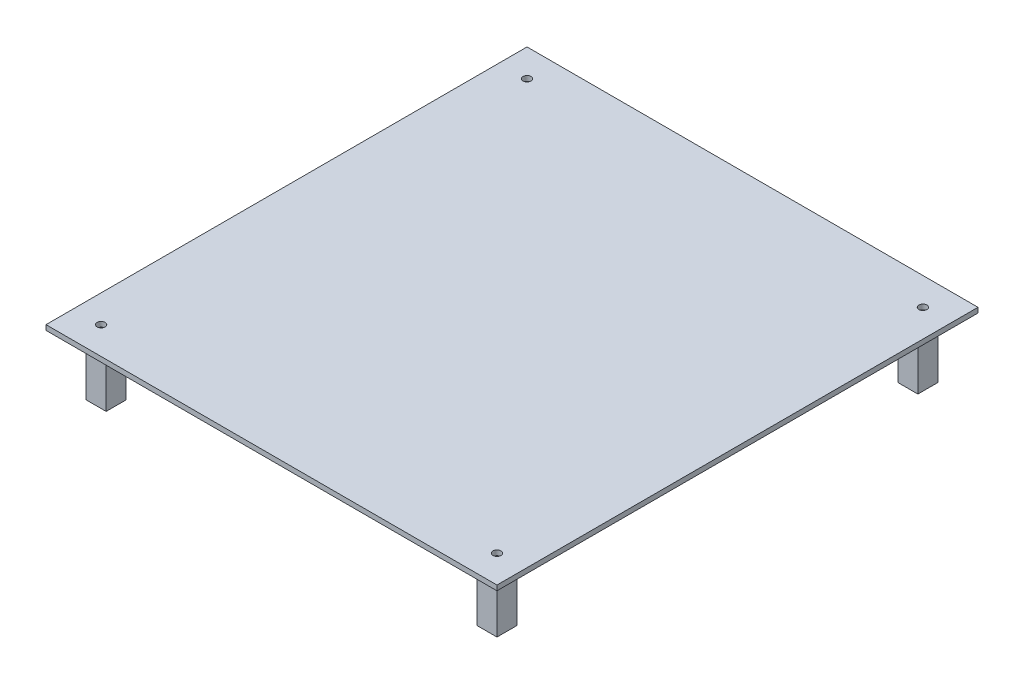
ISO-10303-21;
HEADER;
FILE_DESCRIPTION(('STEP AP214'),'2;1');
FILE_NAME('part.step','',(''),(''),'','','');
FILE_SCHEMA(('AUTOMOTIVE_DESIGN { 1 0 10303 214 1 1 1 1 }'));
ENDSEC;
DATA;
#1=APPLICATION_CONTEXT('core data for automotive mechanical design processes');
#2=APPLICATION_PROTOCOL_DEFINITION('international standard','automotive_design',2000,#1);
#3=PRODUCT_CONTEXT('',#1,'mechanical');
#4=PRODUCT('Part','Part','',(#3));
#5=PRODUCT_RELATED_PRODUCT_CATEGORY('part','',(#4));
#6=PRODUCT_DEFINITION_FORMATION('','',#4);
#7=PRODUCT_DEFINITION_CONTEXT('part definition',#1,'design');
#8=PRODUCT_DEFINITION('design','',#6,#7);
#9=PRODUCT_DEFINITION_SHAPE('','',#8);
#10=(LENGTH_UNIT() NAMED_UNIT(*) SI_UNIT(.MILLI.,.METRE.));
#11=(NAMED_UNIT(*) PLANE_ANGLE_UNIT() SI_UNIT($,.RADIAN.));
#12=(NAMED_UNIT(*) SI_UNIT($,.STERADIAN.) SOLID_ANGLE_UNIT());
#13=UNCERTAINTY_MEASURE_WITH_UNIT(LENGTH_MEASURE(1.E-05),#10,'distance_accuracy_value','');
#14=(GEOMETRIC_REPRESENTATION_CONTEXT(3) GLOBAL_UNCERTAINTY_ASSIGNED_CONTEXT((#13)) GLOBAL_UNIT_ASSIGNED_CONTEXT((#10,
#11,#12)) REPRESENTATION_CONTEXT('',''));
#15=CARTESIAN_POINT('',(0.,0.,0.));
#16=DIRECTION('',(0.,0.,1.));
#17=DIRECTION('',(1.,0.,0.));
#18=AXIS2_PLACEMENT_3D('',#15,#16,#17);
#19=CARTESIAN_POINT('',(520.7,-152.4,558.8));
#20=DIRECTION('',(1.,0.,0.));
#21=DIRECTION('',(0.,0.,-1.));
#22=AXIS2_PLACEMENT_3D('',#19,#20,#21);
#23=PLANE('',#22);
#24=DIRECTION('',(0.,0.,-1.));
#25=VECTOR('',#24,1.);
#26=CARTESIAN_POINT('',(520.7,0.,558.8));
#27=LINE('',#26,#25);
#28=CARTESIAN_POINT('',(520.7,0.,558.8));
#29=VERTEX_POINT('',#28);
#30=CARTESIAN_POINT('',(520.7,0.,508.));
#31=VERTEX_POINT('',#30);
#32=EDGE_CURVE('E156',#29,#31,#27,.T.);
#33=ORIENTED_EDGE('',*,*,#32,.F.);
#34=DIRECTION('',(0.,1.,0.));
#35=VECTOR('',#34,1.);
#36=CARTESIAN_POINT('',(520.7,-152.4,558.8));
#37=LINE('',#36,#35);
#38=CARTESIAN_POINT('',(520.7,-152.4,558.8));
#39=VERTEX_POINT('',#38);
#40=EDGE_CURVE('E12',#39,#29,#37,.T.);
#41=ORIENTED_EDGE('',*,*,#40,.F.);
#42=DIRECTION('',(0.,0.,-1.));
#43=VECTOR('',#42,1.);
#44=CARTESIAN_POINT('',(520.7,-152.4,558.8));
#45=LINE('',#44,#43);
#46=CARTESIAN_POINT('',(520.7,-152.4,508.));
#47=VERTEX_POINT('',#46);
#48=EDGE_CURVE('E160',#39,#47,#45,.T.);
#49=ORIENTED_EDGE('',*,*,#48,.T.);
#50=DIRECTION('',(0.,1.,0.));
#51=VECTOR('',#50,1.);
#52=CARTESIAN_POINT('',(520.7,-152.4,508.));
#53=LINE('',#52,#51);
#54=EDGE_CURVE('E61',#47,#31,#53,.T.);
#55=ORIENTED_EDGE('',*,*,#54,.T.);
#56=EDGE_LOOP('',(#33,#41,#49,#55));
#57=FACE_BOUND('',#56,.T.);
#58=ADVANCED_FACE('F58',(#57),#23,.T.);
#59=CARTESIAN_POINT('',(520.7,-152.4,558.8));
#60=DIRECTION('',(0.,0.,1.));
#61=DIRECTION('',(1.,0.,0.));
#62=AXIS2_PLACEMENT_3D('',#59,#60,#61);
#63=PLANE('',#62);
#64=DIRECTION('',(1.,0.,0.));
#65=VECTOR('',#64,1.);
#66=CARTESIAN_POINT('',(520.7,0.,558.8));
#67=LINE('',#66,#65);
#68=CARTESIAN_POINT('',(469.9,0.,558.8));
#69=VERTEX_POINT('',#68);
#70=EDGE_CURVE('E164',#69,#29,#67,.T.);
#71=ORIENTED_EDGE('',*,*,#70,.F.);
#72=DIRECTION('',(0.,1.,0.));
#73=VECTOR('',#72,1.);
#74=CARTESIAN_POINT('',(469.9,-152.4,558.8));
#75=LINE('',#74,#73);
#76=CARTESIAN_POINT('',(469.9,-152.4,558.8));
#77=VERTEX_POINT('',#76);
#78=EDGE_CURVE('E66',#77,#69,#75,.T.);
#79=ORIENTED_EDGE('',*,*,#78,.F.);
#80=DIRECTION('',(1.,0.,0.));
#81=VECTOR('',#80,1.);
#82=CARTESIAN_POINT('',(520.7,-152.4,558.8));
#83=LINE('',#82,#81);
#84=EDGE_CURVE('E168',#77,#39,#83,.T.);
#85=ORIENTED_EDGE('',*,*,#84,.T.);
#86=ORIENTED_EDGE('',*,*,#40,.T.);
#87=EDGE_LOOP('',(#71,#79,#85,#86));
#88=FACE_BOUND('',#87,.T.);
#89=ADVANCED_FACE('F194',(#88),#63,.T.);
#90=CARTESIAN_POINT('',(469.9,-152.4,558.8));
#91=DIRECTION('',(-1.,0.,0.));
#92=DIRECTION('',(0.,0.,1.));
#93=AXIS2_PLACEMENT_3D('',#90,#91,#92);
#94=PLANE('',#93);
#95=DIRECTION('',(0.,0.,1.));
#96=VECTOR('',#95,1.);
#97=CARTESIAN_POINT('',(469.9,0.,558.8));
#98=LINE('',#97,#96);
#99=CARTESIAN_POINT('',(469.9,0.,508.));
#100=VERTEX_POINT('',#99);
#101=EDGE_CURVE('E174',#100,#69,#98,.T.);
#102=ORIENTED_EDGE('',*,*,#101,.F.);
#103=DIRECTION('',(0.,1.,0.));
#104=VECTOR('',#103,1.);
#105=CARTESIAN_POINT('',(469.9,-152.4,508.));
#106=LINE('',#105,#104);
#107=CARTESIAN_POINT('',(469.9,-152.4,508.));
#108=VERTEX_POINT('',#107);
#109=EDGE_CURVE('E178',#108,#100,#106,.T.);
#110=ORIENTED_EDGE('',*,*,#109,.F.);
#111=DIRECTION('',(0.,0.,1.));
#112=VECTOR('',#111,1.);
#113=CARTESIAN_POINT('',(469.9,-152.4,558.8));
#114=LINE('',#113,#112);
#115=EDGE_CURVE('E166',#108,#77,#114,.T.);
#116=ORIENTED_EDGE('',*,*,#115,.T.);
#117=ORIENTED_EDGE('',*,*,#78,.T.);
#118=EDGE_LOOP('',(#102,#110,#116,#117));
#119=FACE_BOUND('',#118,.T.);
#120=ADVANCED_FACE('F199',(#119),#94,.T.);
#121=CARTESIAN_POINT('',(520.7,-152.4,508.));
#122=DIRECTION('',(0.,0.,-1.));
#123=DIRECTION('',(-1.,0.,0.));
#124=AXIS2_PLACEMENT_3D('',#121,#122,#123);
#125=PLANE('',#124);
#126=DIRECTION('',(-1.,0.,0.));
#127=VECTOR('',#126,1.);
#128=CARTESIAN_POINT('',(520.7,0.,508.));
#129=LINE('',#128,#127);
#130=EDGE_CURVE('E172',#31,#100,#129,.T.);
#131=ORIENTED_EDGE('',*,*,#130,.F.);
#132=ORIENTED_EDGE('',*,*,#54,.F.);
#133=DIRECTION('',(-1.,0.,0.));
#134=VECTOR('',#133,1.);
#135=CARTESIAN_POINT('',(520.7,-152.4,508.));
#136=LINE('',#135,#134);
#137=EDGE_CURVE('E163',#47,#108,#136,.T.);
#138=ORIENTED_EDGE('',*,*,#137,.T.);
#139=ORIENTED_EDGE('',*,*,#109,.T.);
#140=EDGE_LOOP('',(#131,#132,#138,#139));
#141=FACE_BOUND('',#140,.T.);
#142=ADVANCED_FACE('F197',(#141),#125,.T.);
#143=CARTESIAN_POINT('',(0.,-152.4,0.));
#144=DIRECTION('',(0.,1.,0.));
#145=DIRECTION('',(0.,0.,-1.));
#146=AXIS2_PLACEMENT_3D('',#143,#144,#145);
#147=PLANE('',#146);
#148=DIRECTION('',(1.,0.,0.));
#149=VECTOR('',#148,1.);
#150=CARTESIAN_POINT('',(517.525,-152.4,555.625));
#151=LINE('',#150,#149);
#152=CARTESIAN_POINT('',(473.075,-152.4,555.625));
#153=VERTEX_POINT('',#152);
#154=CARTESIAN_POINT('',(517.525,-152.4,555.625));
#155=VERTEX_POINT('',#154);
#156=EDGE_CURVE('E129',#153,#155,#151,.T.);
#157=ORIENTED_EDGE('',*,*,#156,.T.);
#158=DIRECTION('',(0.,0.,-1.));
#159=VECTOR('',#158,1.);
#160=CARTESIAN_POINT('',(517.525,-152.4,555.625));
#161=LINE('',#160,#159);
#162=CARTESIAN_POINT('',(517.525,-152.4,511.175));
#163=VERTEX_POINT('',#162);
#164=EDGE_CURVE('E125',#155,#163,#161,.T.);
#165=ORIENTED_EDGE('',*,*,#164,.T.);
#166=DIRECTION('',(-1.,0.,0.));
#167=VECTOR('',#166,1.);
#168=CARTESIAN_POINT('',(517.525,-152.4,511.175));
#169=LINE('',#168,#167);
#170=CARTESIAN_POINT('',(473.075,-152.4,511.175));
#171=VERTEX_POINT('',#170);
#172=EDGE_CURVE('E132',#163,#171,#169,.T.);
#173=ORIENTED_EDGE('',*,*,#172,.T.);
#174=DIRECTION('',(0.,0.,1.));
#175=VECTOR('',#174,1.);
#176=CARTESIAN_POINT('',(473.075,-152.4,555.625));
#177=LINE('',#176,#175);
#178=EDGE_CURVE('E136',#171,#153,#177,.T.);
#179=ORIENTED_EDGE('',*,*,#178,.T.);
#180=EDGE_LOOP('',(#157,#165,#173,#179));
#181=FACE_BOUND('',#180,.T.);
#182=ORIENTED_EDGE('',*,*,#48,.F.);
#183=ORIENTED_EDGE('',*,*,#84,.F.);
#184=ORIENTED_EDGE('',*,*,#115,.F.);
#185=ORIENTED_EDGE('',*,*,#137,.F.);
#186=EDGE_LOOP('',(#182,#183,#184,#185));
#187=FACE_BOUND('',#186,.T.);
#188=ADVANCED_FACE('F138',(#181,#187),#147,.F.);
#189=CARTESIAN_POINT('',(0.,0.,0.));
#190=DIRECTION('',(0.,1.,0.));
#191=DIRECTION('',(0.,0.,-1.));
#192=AXIS2_PLACEMENT_3D('',#189,#190,#191);
#193=PLANE('',#192);
#194=DIRECTION('',(0.,0.,-1.));
#195=VECTOR('',#194,1.);
#196=CARTESIAN_POINT('',(517.525,0.,555.625));
#197=LINE('',#196,#195);
#198=CARTESIAN_POINT('',(517.525,0.,555.625));
#199=VERTEX_POINT('',#198);
#200=CARTESIAN_POINT('',(517.525,0.,511.175));
#201=VERTEX_POINT('',#200);
#202=EDGE_CURVE('E128',#199,#201,#197,.T.);
#203=ORIENTED_EDGE('',*,*,#202,.F.);
#204=DIRECTION('',(1.,0.,0.));
#205=VECTOR('',#204,1.);
#206=CARTESIAN_POINT('',(517.525,0.,555.625));
#207=LINE('',#206,#205);
#208=CARTESIAN_POINT('',(473.075,0.,555.625));
#209=VERTEX_POINT('',#208);
#210=EDGE_CURVE('E141',#209,#199,#207,.T.);
#211=ORIENTED_EDGE('',*,*,#210,.F.);
#212=DIRECTION('',(0.,0.,1.));
#213=VECTOR('',#212,1.);
#214=CARTESIAN_POINT('',(473.075,0.,555.625));
#215=LINE('',#214,#213);
#216=CARTESIAN_POINT('',(473.075,0.,511.175));
#217=VERTEX_POINT('',#216);
#218=EDGE_CURVE('E144',#217,#209,#215,.T.);
#219=ORIENTED_EDGE('',*,*,#218,.F.);
#220=DIRECTION('',(-1.,0.,0.));
#221=VECTOR('',#220,1.);
#222=CARTESIAN_POINT('',(517.525,0.,511.175));
#223=LINE('',#222,#221);
#224=EDGE_CURVE('E150',#201,#217,#223,.T.);
#225=ORIENTED_EDGE('',*,*,#224,.F.);
#226=EDGE_LOOP('',(#203,#211,#219,#225));
#227=FACE_BOUND('',#226,.T.);
#228=ORIENTED_EDGE('',*,*,#32,.T.);
#229=ORIENTED_EDGE('',*,*,#130,.T.);
#230=ORIENTED_EDGE('',*,*,#101,.T.);
#231=ORIENTED_EDGE('',*,*,#70,.T.);
#232=EDGE_LOOP('',(#228,#229,#230,#231));
#233=FACE_BOUND('',#232,.T.);
#234=ADVANCED_FACE('F190',(#227,#233),#193,.T.);
#235=CARTESIAN_POINT('',(517.525,-152.4,555.625));
#236=DIRECTION('',(1.,0.,0.));
#237=DIRECTION('',(0.,0.,-1.));
#238=AXIS2_PLACEMENT_3D('',#235,#236,#237);
#239=PLANE('',#238);
#240=ORIENTED_EDGE('',*,*,#202,.T.);
#241=DIRECTION('',(0.,1.,0.));
#242=VECTOR('',#241,1.);
#243=CARTESIAN_POINT('',(517.525,-152.4,511.175));
#244=LINE('',#243,#242);
#245=EDGE_CURVE('E79',#163,#201,#244,.T.);
#246=ORIENTED_EDGE('',*,*,#245,.F.);
#247=ORIENTED_EDGE('',*,*,#164,.F.);
#248=DIRECTION('',(0.,1.,0.));
#249=VECTOR('',#248,1.);
#250=CARTESIAN_POINT('',(517.525,-152.4,555.625));
#251=LINE('',#250,#249);
#252=EDGE_CURVE('E154',#155,#199,#251,.T.);
#253=ORIENTED_EDGE('',*,*,#252,.T.);
#254=EDGE_LOOP('',(#240,#246,#247,#253));
#255=FACE_BOUND('',#254,.T.);
#256=ADVANCED_FACE('F123',(#255),#239,.F.);
#257=CARTESIAN_POINT('',(517.525,-152.4,555.625));
#258=DIRECTION('',(0.,0.,1.));
#259=DIRECTION('',(1.,0.,0.));
#260=AXIS2_PLACEMENT_3D('',#257,#258,#259);
#261=PLANE('',#260);
#262=ORIENTED_EDGE('',*,*,#210,.T.);
#263=ORIENTED_EDGE('',*,*,#252,.F.);
#264=ORIENTED_EDGE('',*,*,#156,.F.);
#265=DIRECTION('',(0.,1.,0.));
#266=VECTOR('',#265,1.);
#267=CARTESIAN_POINT('',(473.075,-152.4,555.625));
#268=LINE('',#267,#266);
#269=EDGE_CURVE('E157',#153,#209,#268,.T.);
#270=ORIENTED_EDGE('',*,*,#269,.T.);
#271=EDGE_LOOP('',(#262,#263,#264,#270));
#272=FACE_BOUND('',#271,.T.);
#273=ADVANCED_FACE('F220',(#272),#261,.F.);
#274=CARTESIAN_POINT('',(473.075,-152.4,555.625));
#275=DIRECTION('',(-1.,0.,0.));
#276=DIRECTION('',(0.,0.,1.));
#277=AXIS2_PLACEMENT_3D('',#274,#275,#276);
#278=PLANE('',#277);
#279=ORIENTED_EDGE('',*,*,#218,.T.);
#280=ORIENTED_EDGE('',*,*,#269,.F.);
#281=ORIENTED_EDGE('',*,*,#178,.F.);
#282=DIRECTION('',(0.,1.,0.));
#283=VECTOR('',#282,1.);
#284=CARTESIAN_POINT('',(473.075,-152.4,511.175));
#285=LINE('',#284,#283);
#286=EDGE_CURVE('E74',#171,#217,#285,.T.);
#287=ORIENTED_EDGE('',*,*,#286,.T.);
#288=EDGE_LOOP('',(#279,#280,#281,#287));
#289=FACE_BOUND('',#288,.T.);
#290=ADVANCED_FACE('F223',(#289),#278,.F.);
#291=CARTESIAN_POINT('',(517.525,-152.4,511.175));
#292=DIRECTION('',(0.,0.,-1.));
#293=DIRECTION('',(-1.,0.,0.));
#294=AXIS2_PLACEMENT_3D('',#291,#292,#293);
#295=PLANE('',#294);
#296=ORIENTED_EDGE('',*,*,#224,.T.);
#297=ORIENTED_EDGE('',*,*,#286,.F.);
#298=ORIENTED_EDGE('',*,*,#172,.F.);
#299=ORIENTED_EDGE('',*,*,#245,.T.);
#300=EDGE_LOOP('',(#296,#297,#298,#299));
#301=FACE_BOUND('',#300,.T.);
#302=ADVANCED_FACE('F133',(#301),#295,.F.);
#303=CLOSED_SHELL('',(#58,#89,#120,#142,#188,#234,#256,#273,#290,#302));
#304=MANIFOLD_SOLID_BREP('B2',#303);
#305=CARTESIAN_POINT('',(-520.7,-152.4,558.8));
#306=DIRECTION('',(-1.,0.,0.));
#307=DIRECTION('',(0.,0.,-1.));
#308=AXIS2_PLACEMENT_3D('',#305,#306,#307);
#309=PLANE('',#308);
#310=DIRECTION('',(0.,0.,-1.));
#311=VECTOR('',#310,1.);
#312=CARTESIAN_POINT('',(-520.7,0.,558.8));
#313=LINE('',#312,#311);
#314=CARTESIAN_POINT('',(-520.7,0.,558.8));
#315=VERTEX_POINT('',#314);
#316=CARTESIAN_POINT('',(-520.7,0.,508.));
#317=VERTEX_POINT('',#316);
#318=EDGE_CURVE('E398',#315,#317,#313,.T.);
#319=ORIENTED_EDGE('',*,*,#318,.T.);
#320=DIRECTION('',(0.,1.,0.));
#321=VECTOR('',#320,1.);
#322=CARTESIAN_POINT('',(-520.7,-152.4,508.));
#323=LINE('',#322,#321);
#324=CARTESIAN_POINT('',(-520.7,-152.4,508.));
#325=VERTEX_POINT('',#324);
#326=EDGE_CURVE('E301',#325,#317,#323,.T.);
#327=ORIENTED_EDGE('',*,*,#326,.F.);
#328=DIRECTION('',(0.,0.,-1.));
#329=VECTOR('',#328,1.);
#330=CARTESIAN_POINT('',(-520.7,-152.4,558.8));
#331=LINE('',#330,#329);
#332=CARTESIAN_POINT('',(-520.7,-152.4,558.8));
#333=VERTEX_POINT('',#332);
#334=EDGE_CURVE('E402',#333,#325,#331,.T.);
#335=ORIENTED_EDGE('',*,*,#334,.F.);
#336=DIRECTION('',(0.,1.,0.));
#337=VECTOR('',#336,1.);
#338=CARTESIAN_POINT('',(-520.7,-152.4,558.8));
#339=LINE('',#338,#337);
#340=EDGE_CURVE('E56',#333,#315,#339,.T.);
#341=ORIENTED_EDGE('',*,*,#340,.T.);
#342=EDGE_LOOP('',(#319,#327,#335,#341));
#343=FACE_BOUND('',#342,.T.);
#344=ADVANCED_FACE('F298',(#343),#309,.T.);
#345=CARTESIAN_POINT('',(-520.7,-152.4,558.8));
#346=DIRECTION('',(0.,0.,1.));
#347=DIRECTION('',(-1.,0.,0.));
#348=AXIS2_PLACEMENT_3D('',#345,#346,#347);
#349=PLANE('',#348);
#350=DIRECTION('',(-1.,0.,0.));
#351=VECTOR('',#350,1.);
#352=CARTESIAN_POINT('',(-520.7,0.,558.8));
#353=LINE('',#352,#351);
#354=CARTESIAN_POINT('',(-469.9,0.,558.8));
#355=VERTEX_POINT('',#354);
#356=EDGE_CURVE('E406',#355,#315,#353,.T.);
#357=ORIENTED_EDGE('',*,*,#356,.T.);
#358=ORIENTED_EDGE('',*,*,#340,.F.);
#359=DIRECTION('',(-1.,0.,0.));
#360=VECTOR('',#359,1.);
#361=CARTESIAN_POINT('',(-520.7,-152.4,558.8));
#362=LINE('',#361,#360);
#363=CARTESIAN_POINT('',(-469.9,-152.4,558.8));
#364=VERTEX_POINT('',#363);
#365=EDGE_CURVE('E410',#364,#333,#362,.T.);
#366=ORIENTED_EDGE('',*,*,#365,.F.);
#367=DIRECTION('',(0.,1.,0.));
#368=VECTOR('',#367,1.);
#369=CARTESIAN_POINT('',(-469.9,-152.4,558.8));
#370=LINE('',#369,#368);
#371=EDGE_CURVE('E306',#364,#355,#370,.T.);
#372=ORIENTED_EDGE('',*,*,#371,.T.);
#373=EDGE_LOOP('',(#357,#358,#366,#372));
#374=FACE_BOUND('',#373,.T.);
#375=ADVANCED_FACE('F441',(#374),#349,.T.);
#376=CARTESIAN_POINT('',(-469.9,-152.4,558.8));
#377=DIRECTION('',(1.,0.,0.));
#378=DIRECTION('',(0.,0.,1.));
#379=AXIS2_PLACEMENT_3D('',#376,#377,#378);
#380=PLANE('',#379);
#381=DIRECTION('',(0.,0.,1.));
#382=VECTOR('',#381,1.);
#383=CARTESIAN_POINT('',(-469.9,0.,558.8));
#384=LINE('',#383,#382);
#385=CARTESIAN_POINT('',(-469.9,0.,508.));
#386=VERTEX_POINT('',#385);
#387=EDGE_CURVE('E416',#386,#355,#384,.T.);
#388=ORIENTED_EDGE('',*,*,#387,.T.);
#389=ORIENTED_EDGE('',*,*,#371,.F.);
#390=DIRECTION('',(0.,0.,1.));
#391=VECTOR('',#390,1.);
#392=CARTESIAN_POINT('',(-469.9,-152.4,558.8));
#393=LINE('',#392,#391);
#394=CARTESIAN_POINT('',(-469.9,-152.4,508.));
#395=VERTEX_POINT('',#394);
#396=EDGE_CURVE('E408',#395,#364,#393,.T.);
#397=ORIENTED_EDGE('',*,*,#396,.F.);
#398=DIRECTION('',(0.,1.,0.));
#399=VECTOR('',#398,1.);
#400=CARTESIAN_POINT('',(-469.9,-152.4,508.));
#401=LINE('',#400,#399);
#402=EDGE_CURVE('E420',#395,#386,#401,.T.);
#403=ORIENTED_EDGE('',*,*,#402,.T.);
#404=EDGE_LOOP('',(#388,#389,#397,#403));
#405=FACE_BOUND('',#404,.T.);
#406=ADVANCED_FACE('F438',(#405),#380,.T.);
#407=CARTESIAN_POINT('',(-520.7,-152.4,508.));
#408=DIRECTION('',(0.,0.,-1.));
#409=DIRECTION('',(1.,0.,0.));
#410=AXIS2_PLACEMENT_3D('',#407,#408,#409);
#411=PLANE('',#410);
#412=DIRECTION('',(1.,0.,0.));
#413=VECTOR('',#412,1.);
#414=CARTESIAN_POINT('',(-520.7,0.,508.));
#415=LINE('',#414,#413);
#416=EDGE_CURVE('E414',#317,#386,#415,.T.);
#417=ORIENTED_EDGE('',*,*,#416,.T.);
#418=ORIENTED_EDGE('',*,*,#402,.F.);
#419=DIRECTION('',(1.,0.,0.));
#420=VECTOR('',#419,1.);
#421=CARTESIAN_POINT('',(-520.7,-152.4,508.));
#422=LINE('',#421,#420);
#423=EDGE_CURVE('E405',#325,#395,#422,.T.);
#424=ORIENTED_EDGE('',*,*,#423,.F.);
#425=ORIENTED_EDGE('',*,*,#326,.T.);
#426=EDGE_LOOP('',(#417,#418,#424,#425));
#427=FACE_BOUND('',#426,.T.);
#428=ADVANCED_FACE('F429',(#427),#411,.T.);
#429=CARTESIAN_POINT('',(0.,-152.4,0.));
#430=DIRECTION('',(0.,1.,0.));
#431=DIRECTION('',(0.,0.,-1.));
#432=AXIS2_PLACEMENT_3D('',#429,#430,#431);
#433=PLANE('',#432);
#434=DIRECTION('',(-1.,0.,0.));
#435=VECTOR('',#434,1.);
#436=CARTESIAN_POINT('',(-517.525,-152.4,555.625));
#437=LINE('',#436,#435);
#438=CARTESIAN_POINT('',(-473.075,-152.4,555.625));
#439=VERTEX_POINT('',#438);
#440=CARTESIAN_POINT('',(-517.525,-152.4,555.625));
#441=VERTEX_POINT('',#440);
#442=EDGE_CURVE('E371',#439,#441,#437,.T.);
#443=ORIENTED_EDGE('',*,*,#442,.F.);
#444=DIRECTION('',(0.,0.,1.));
#445=VECTOR('',#444,1.);
#446=CARTESIAN_POINT('',(-473.075,-152.4,555.625));
#447=LINE('',#446,#445);
#448=CARTESIAN_POINT('',(-473.075,-152.4,511.175));
#449=VERTEX_POINT('',#448);
#450=EDGE_CURVE('E384',#449,#439,#447,.T.);
#451=ORIENTED_EDGE('',*,*,#450,.F.);
#452=DIRECTION('',(1.,0.,0.));
#453=VECTOR('',#452,1.);
#454=CARTESIAN_POINT('',(-517.525,-152.4,511.175));
#455=LINE('',#454,#453);
#456=CARTESIAN_POINT('',(-517.525,-152.4,511.175));
#457=VERTEX_POINT('',#456);
#458=EDGE_CURVE('E366',#457,#449,#455,.T.);
#459=ORIENTED_EDGE('',*,*,#458,.F.);
#460=DIRECTION('',(0.,0.,-1.));
#461=VECTOR('',#460,1.);
#462=CARTESIAN_POINT('',(-517.525,-152.4,555.625));
#463=LINE('',#462,#461);
#464=EDGE_CURVE('E374',#441,#457,#463,.T.);
#465=ORIENTED_EDGE('',*,*,#464,.F.);
#466=EDGE_LOOP('',(#443,#451,#459,#465));
#467=FACE_BOUND('',#466,.T.);
#468=ORIENTED_EDGE('',*,*,#334,.T.);
#469=ORIENTED_EDGE('',*,*,#423,.T.);
#470=ORIENTED_EDGE('',*,*,#396,.T.);
#471=ORIENTED_EDGE('',*,*,#365,.T.);
#472=EDGE_LOOP('',(#468,#469,#470,#471));
#473=FACE_BOUND('',#472,.T.);
#474=ADVANCED_FACE('F382',(#467,#473),#433,.F.);
#475=CARTESIAN_POINT('',(0.,0.,0.));
#476=DIRECTION('',(0.,1.,0.));
#477=DIRECTION('',(0.,0.,-1.));
#478=AXIS2_PLACEMENT_3D('',#475,#476,#477);
#479=PLANE('',#478);
#480=DIRECTION('',(0.,0.,-1.));
#481=VECTOR('',#480,1.);
#482=CARTESIAN_POINT('',(-517.525,0.,555.625));
#483=LINE('',#482,#481);
#484=CARTESIAN_POINT('',(-517.525,0.,555.625));
#485=VERTEX_POINT('',#484);
#486=CARTESIAN_POINT('',(-517.525,0.,511.175));
#487=VERTEX_POINT('',#486);
#488=EDGE_CURVE('E389',#485,#487,#483,.T.);
#489=ORIENTED_EDGE('',*,*,#488,.T.);
#490=DIRECTION('',(1.,0.,0.));
#491=VECTOR('',#490,1.);
#492=CARTESIAN_POINT('',(-517.525,0.,511.175));
#493=LINE('',#492,#491);
#494=CARTESIAN_POINT('',(-473.075,0.,511.175));
#495=VERTEX_POINT('',#494);
#496=EDGE_CURVE('E369',#487,#495,#493,.T.);
#497=ORIENTED_EDGE('',*,*,#496,.T.);
#498=DIRECTION('',(0.,0.,1.));
#499=VECTOR('',#498,1.);
#500=CARTESIAN_POINT('',(-473.075,0.,555.625));
#501=LINE('',#500,#499);
#502=CARTESIAN_POINT('',(-473.075,0.,555.625));
#503=VERTEX_POINT('',#502);
#504=EDGE_CURVE('E392',#495,#503,#501,.T.);
#505=ORIENTED_EDGE('',*,*,#504,.T.);
#506=DIRECTION('',(-1.,0.,0.));
#507=VECTOR('',#506,1.);
#508=CARTESIAN_POINT('',(-517.525,0.,555.625));
#509=LINE('',#508,#507);
#510=EDGE_CURVE('E380',#503,#485,#509,.T.);
#511=ORIENTED_EDGE('',*,*,#510,.T.);
#512=EDGE_LOOP('',(#489,#497,#505,#511));
#513=FACE_BOUND('',#512,.T.);
#514=ORIENTED_EDGE('',*,*,#318,.F.);
#515=ORIENTED_EDGE('',*,*,#356,.F.);
#516=ORIENTED_EDGE('',*,*,#387,.F.);
#517=ORIENTED_EDGE('',*,*,#416,.F.);
#518=EDGE_LOOP('',(#514,#515,#516,#517));
#519=FACE_BOUND('',#518,.T.);
#520=ADVANCED_FACE('F436',(#513,#519),#479,.T.);
#521=CARTESIAN_POINT('',(-517.525,-152.4,555.625));
#522=DIRECTION('',(-1.,0.,0.));
#523=DIRECTION('',(0.,0.,-1.));
#524=AXIS2_PLACEMENT_3D('',#521,#522,#523);
#525=PLANE('',#524);
#526=ORIENTED_EDGE('',*,*,#488,.F.);
#527=DIRECTION('',(0.,1.,0.));
#528=VECTOR('',#527,1.);
#529=CARTESIAN_POINT('',(-517.525,-152.4,555.625));
#530=LINE('',#529,#528);
#531=EDGE_CURVE('E376',#441,#485,#530,.T.);
#532=ORIENTED_EDGE('',*,*,#531,.F.);
#533=ORIENTED_EDGE('',*,*,#464,.T.);
#534=DIRECTION('',(0.,1.,0.));
#535=VECTOR('',#534,1.);
#536=CARTESIAN_POINT('',(-517.525,-152.4,511.175));
#537=LINE('',#536,#535);
#538=EDGE_CURVE('E322',#457,#487,#537,.T.);
#539=ORIENTED_EDGE('',*,*,#538,.T.);
#540=EDGE_LOOP('',(#526,#532,#533,#539));
#541=FACE_BOUND('',#540,.T.);
#542=ADVANCED_FACE('F375',(#541),#525,.F.);
#543=CARTESIAN_POINT('',(-517.525,-152.4,555.625));
#544=DIRECTION('',(0.,0.,1.));
#545=DIRECTION('',(-1.,0.,0.));
#546=AXIS2_PLACEMENT_3D('',#543,#544,#545);
#547=PLANE('',#546);
#548=ORIENTED_EDGE('',*,*,#510,.F.);
#549=DIRECTION('',(0.,1.,0.));
#550=VECTOR('',#549,1.);
#551=CARTESIAN_POINT('',(-473.075,-152.4,555.625));
#552=LINE('',#551,#550);
#553=EDGE_CURVE('E399',#439,#503,#552,.T.);
#554=ORIENTED_EDGE('',*,*,#553,.F.);
#555=ORIENTED_EDGE('',*,*,#442,.T.);
#556=ORIENTED_EDGE('',*,*,#531,.T.);
#557=EDGE_LOOP('',(#548,#554,#555,#556));
#558=FACE_BOUND('',#557,.T.);
#559=ADVANCED_FACE('F489',(#558),#547,.F.);
#560=CARTESIAN_POINT('',(-473.075,-152.4,555.625));
#561=DIRECTION('',(1.,0.,0.));
#562=DIRECTION('',(0.,0.,1.));
#563=AXIS2_PLACEMENT_3D('',#560,#561,#562);
#564=PLANE('',#563);
#565=ORIENTED_EDGE('',*,*,#504,.F.);
#566=DIRECTION('',(0.,1.,0.));
#567=VECTOR('',#566,1.);
#568=CARTESIAN_POINT('',(-473.075,-152.4,511.175));
#569=LINE('',#568,#567);
#570=EDGE_CURVE('E314',#449,#495,#569,.T.);
#571=ORIENTED_EDGE('',*,*,#570,.F.);
#572=ORIENTED_EDGE('',*,*,#450,.T.);
#573=ORIENTED_EDGE('',*,*,#553,.T.);
#574=EDGE_LOOP('',(#565,#571,#572,#573));
#575=FACE_BOUND('',#574,.T.);
#576=ADVANCED_FACE('F497',(#575),#564,.F.);
#577=CARTESIAN_POINT('',(-517.525,-152.4,511.175));
#578=DIRECTION('',(0.,0.,-1.));
#579=DIRECTION('',(1.,0.,0.));
#580=AXIS2_PLACEMENT_3D('',#577,#578,#579);
#581=PLANE('',#580);
#582=ORIENTED_EDGE('',*,*,#496,.F.);
#583=ORIENTED_EDGE('',*,*,#538,.F.);
#584=ORIENTED_EDGE('',*,*,#458,.T.);
#585=ORIENTED_EDGE('',*,*,#570,.T.);
#586=EDGE_LOOP('',(#582,#583,#584,#585));
#587=FACE_BOUND('',#586,.T.);
#588=ADVANCED_FACE('F364',(#587),#581,.F.);
#589=CLOSED_SHELL('',(#344,#375,#406,#428,#474,#520,#542,#559,#576,#588));
#590=MANIFOLD_SOLID_BREP('B6',#589);
#591=CARTESIAN_POINT('',(520.7,-152.4,-558.8));
#592=DIRECTION('',(1.,0.,0.));
#593=DIRECTION('',(0.,0.,1.));
#594=AXIS2_PLACEMENT_3D('',#591,#592,#593);
#595=PLANE('',#594);
#596=DIRECTION('',(0.,0.,1.));
#597=VECTOR('',#596,1.);
#598=CARTESIAN_POINT('',(520.7,0.,-558.8));
#599=LINE('',#598,#597);
#600=CARTESIAN_POINT('',(520.7,0.,-558.8));
#601=VERTEX_POINT('',#600);
#602=CARTESIAN_POINT('',(520.7,0.,-508.));
#603=VERTEX_POINT('',#602);
#604=EDGE_CURVE('E638',#601,#603,#599,.T.);
#605=ORIENTED_EDGE('',*,*,#604,.T.);
#606=DIRECTION('',(0.,1.,0.));
#607=VECTOR('',#606,1.);
#608=CARTESIAN_POINT('',(520.7,-152.4,-508.));
#609=LINE('',#608,#607);
#610=CARTESIAN_POINT('',(520.7,-152.4,-508.));
#611=VERTEX_POINT('',#610);
#612=EDGE_CURVE('E541',#611,#603,#609,.T.);
#613=ORIENTED_EDGE('',*,*,#612,.F.);
#614=DIRECTION('',(0.,0.,1.));
#615=VECTOR('',#614,1.);
#616=CARTESIAN_POINT('',(520.7,-152.4,-558.8));
#617=LINE('',#616,#615);
#618=CARTESIAN_POINT('',(520.7,-152.4,-558.8));
#619=VERTEX_POINT('',#618);
#620=EDGE_CURVE('E642',#619,#611,#617,.T.);
#621=ORIENTED_EDGE('',*,*,#620,.F.);
#622=DIRECTION('',(0.,1.,0.));
#623=VECTOR('',#622,1.);
#624=CARTESIAN_POINT('',(520.7,-152.4,-558.8));
#625=LINE('',#624,#623);
#626=EDGE_CURVE('E296',#619,#601,#625,.T.);
#627=ORIENTED_EDGE('',*,*,#626,.T.);
#628=EDGE_LOOP('',(#605,#613,#621,#627));
#629=FACE_BOUND('',#628,.T.);
#630=ADVANCED_FACE('F538',(#629),#595,.T.);
#631=CARTESIAN_POINT('',(520.7,-152.4,-558.8));
#632=DIRECTION('',(0.,0.,-1.));
#633=DIRECTION('',(1.,0.,0.));
#634=AXIS2_PLACEMENT_3D('',#631,#632,#633);
#635=PLANE('',#634);
#636=DIRECTION('',(1.,0.,0.));
#637=VECTOR('',#636,1.);
#638=CARTESIAN_POINT('',(520.7,0.,-558.8));
#639=LINE('',#638,#637);
#640=CARTESIAN_POINT('',(469.9,0.,-558.8));
#641=VERTEX_POINT('',#640);
#642=EDGE_CURVE('E646',#641,#601,#639,.T.);
#643=ORIENTED_EDGE('',*,*,#642,.T.);
#644=ORIENTED_EDGE('',*,*,#626,.F.);
#645=DIRECTION('',(1.,0.,0.));
#646=VECTOR('',#645,1.);
#647=CARTESIAN_POINT('',(520.7,-152.4,-558.8));
#648=LINE('',#647,#646);
#649=CARTESIAN_POINT('',(469.9,-152.4,-558.8));
#650=VERTEX_POINT('',#649);
#651=EDGE_CURVE('E650',#650,#619,#648,.T.);
#652=ORIENTED_EDGE('',*,*,#651,.F.);
#653=DIRECTION('',(0.,1.,0.));
#654=VECTOR('',#653,1.);
#655=CARTESIAN_POINT('',(469.9,-152.4,-558.8));
#656=LINE('',#655,#654);
#657=EDGE_CURVE('E546',#650,#641,#656,.T.);
#658=ORIENTED_EDGE('',*,*,#657,.T.);
#659=EDGE_LOOP('',(#643,#644,#652,#658));
#660=FACE_BOUND('',#659,.T.);
#661=ADVANCED_FACE('F681',(#660),#635,.T.);
#662=CARTESIAN_POINT('',(469.9,-152.4,-558.8));
#663=DIRECTION('',(-1.,0.,0.));
#664=DIRECTION('',(0.,0.,-1.));
#665=AXIS2_PLACEMENT_3D('',#662,#663,#664);
#666=PLANE('',#665);
#667=DIRECTION('',(0.,0.,-1.));
#668=VECTOR('',#667,1.);
#669=CARTESIAN_POINT('',(469.9,0.,-558.8));
#670=LINE('',#669,#668);
#671=CARTESIAN_POINT('',(469.9,0.,-508.));
#672=VERTEX_POINT('',#671);
#673=EDGE_CURVE('E656',#672,#641,#670,.T.);
#674=ORIENTED_EDGE('',*,*,#673,.T.);
#675=ORIENTED_EDGE('',*,*,#657,.F.);
#676=DIRECTION('',(0.,0.,-1.));
#677=VECTOR('',#676,1.);
#678=CARTESIAN_POINT('',(469.9,-152.4,-558.8));
#679=LINE('',#678,#677);
#680=CARTESIAN_POINT('',(469.9,-152.4,-508.));
#681=VERTEX_POINT('',#680);
#682=EDGE_CURVE('E648',#681,#650,#679,.T.);
#683=ORIENTED_EDGE('',*,*,#682,.F.);
#684=DIRECTION('',(0.,1.,0.));
#685=VECTOR('',#684,1.);
#686=CARTESIAN_POINT('',(469.9,-152.4,-508.));
#687=LINE('',#686,#685);
#688=EDGE_CURVE('E660',#681,#672,#687,.T.);
#689=ORIENTED_EDGE('',*,*,#688,.T.);
#690=EDGE_LOOP('',(#674,#675,#683,#689));
#691=FACE_BOUND('',#690,.T.);
#692=ADVANCED_FACE('F678',(#691),#666,.T.);
#693=CARTESIAN_POINT('',(520.7,-152.4,-508.));
#694=DIRECTION('',(0.,0.,1.));
#695=DIRECTION('',(-1.,0.,0.));
#696=AXIS2_PLACEMENT_3D('',#693,#694,#695);
#697=PLANE('',#696);
#698=DIRECTION('',(-1.,0.,0.));
#699=VECTOR('',#698,1.);
#700=CARTESIAN_POINT('',(520.7,0.,-508.));
#701=LINE('',#700,#699);
#702=EDGE_CURVE('E654',#603,#672,#701,.T.);
#703=ORIENTED_EDGE('',*,*,#702,.T.);
#704=ORIENTED_EDGE('',*,*,#688,.F.);
#705=DIRECTION('',(-1.,0.,0.));
#706=VECTOR('',#705,1.);
#707=CARTESIAN_POINT('',(520.7,-152.4,-508.));
#708=LINE('',#707,#706);
#709=EDGE_CURVE('E645',#611,#681,#708,.T.);
#710=ORIENTED_EDGE('',*,*,#709,.F.);
#711=ORIENTED_EDGE('',*,*,#612,.T.);
#712=EDGE_LOOP('',(#703,#704,#710,#711));
#713=FACE_BOUND('',#712,.T.);
#714=ADVANCED_FACE('F669',(#713),#697,.T.);
#715=CARTESIAN_POINT('',(0.,-152.4,0.));
#716=DIRECTION('',(0.,1.,0.));
#717=DIRECTION('',(0.,0.,1.));
#718=AXIS2_PLACEMENT_3D('',#715,#716,#717);
#719=PLANE('',#718);
#720=DIRECTION('',(1.,0.,0.));
#721=VECTOR('',#720,1.);
#722=CARTESIAN_POINT('',(517.525,-152.4,-555.625));
#723=LINE('',#722,#721);
#724=CARTESIAN_POINT('',(473.075,-152.4,-555.625));
#725=VERTEX_POINT('',#724);
#726=CARTESIAN_POINT('',(517.525,-152.4,-555.625));
#727=VERTEX_POINT('',#726);
#728=EDGE_CURVE('E611',#725,#727,#723,.T.);
#729=ORIENTED_EDGE('',*,*,#728,.F.);
#730=DIRECTION('',(0.,0.,-1.));
#731=VECTOR('',#730,1.);
#732=CARTESIAN_POINT('',(473.075,-152.4,-555.625));
#733=LINE('',#732,#731);
#734=CARTESIAN_POINT('',(473.075,-152.4,-511.175));
#735=VERTEX_POINT('',#734);
#736=EDGE_CURVE('E624',#735,#725,#733,.T.);
#737=ORIENTED_EDGE('',*,*,#736,.F.);
#738=DIRECTION('',(-1.,0.,0.));
#739=VECTOR('',#738,1.);
#740=CARTESIAN_POINT('',(517.525,-152.4,-511.175));
#741=LINE('',#740,#739);
#742=CARTESIAN_POINT('',(517.525,-152.4,-511.175));
#743=VERTEX_POINT('',#742);
#744=EDGE_CURVE('E606',#743,#735,#741,.T.);
#745=ORIENTED_EDGE('',*,*,#744,.F.);
#746=DIRECTION('',(0.,0.,1.));
#747=VECTOR('',#746,1.);
#748=CARTESIAN_POINT('',(517.525,-152.4,-555.625));
#749=LINE('',#748,#747);
#750=EDGE_CURVE('E614',#727,#743,#749,.T.);
#751=ORIENTED_EDGE('',*,*,#750,.F.);
#752=EDGE_LOOP('',(#729,#737,#745,#751));
#753=FACE_BOUND('',#752,.T.);
#754=ORIENTED_EDGE('',*,*,#620,.T.);
#755=ORIENTED_EDGE('',*,*,#709,.T.);
#756=ORIENTED_EDGE('',*,*,#682,.T.);
#757=ORIENTED_EDGE('',*,*,#651,.T.);
#758=EDGE_LOOP('',(#754,#755,#756,#757));
#759=FACE_BOUND('',#758,.T.);
#760=ADVANCED_FACE('F622',(#753,#759),#719,.F.);
#761=CARTESIAN_POINT('',(0.,0.,0.));
#762=DIRECTION('',(0.,1.,0.));
#763=DIRECTION('',(0.,0.,1.));
#764=AXIS2_PLACEMENT_3D('',#761,#762,#763);
#765=PLANE('',#764);
#766=DIRECTION('',(0.,0.,1.));
#767=VECTOR('',#766,1.);
#768=CARTESIAN_POINT('',(517.525,0.,-555.625));
#769=LINE('',#768,#767);
#770=CARTESIAN_POINT('',(517.525,0.,-555.625));
#771=VERTEX_POINT('',#770);
#772=CARTESIAN_POINT('',(517.525,0.,-511.175));
#773=VERTEX_POINT('',#772);
#774=EDGE_CURVE('E629',#771,#773,#769,.T.);
#775=ORIENTED_EDGE('',*,*,#774,.T.);
#776=DIRECTION('',(-1.,0.,0.));
#777=VECTOR('',#776,1.);
#778=CARTESIAN_POINT('',(517.525,0.,-511.175));
#779=LINE('',#778,#777);
#780=CARTESIAN_POINT('',(473.075,0.,-511.175));
#781=VERTEX_POINT('',#780);
#782=EDGE_CURVE('E609',#773,#781,#779,.T.);
#783=ORIENTED_EDGE('',*,*,#782,.T.);
#784=DIRECTION('',(0.,0.,-1.));
#785=VECTOR('',#784,1.);
#786=CARTESIAN_POINT('',(473.075,0.,-555.625));
#787=LINE('',#786,#785);
#788=CARTESIAN_POINT('',(473.075,0.,-555.625));
#789=VERTEX_POINT('',#788);
#790=EDGE_CURVE('E632',#781,#789,#787,.T.);
#791=ORIENTED_EDGE('',*,*,#790,.T.);
#792=DIRECTION('',(1.,0.,0.));
#793=VECTOR('',#792,1.);
#794=CARTESIAN_POINT('',(517.525,0.,-555.625));
#795=LINE('',#794,#793);
#796=EDGE_CURVE('E620',#789,#771,#795,.T.);
#797=ORIENTED_EDGE('',*,*,#796,.T.);
#798=EDGE_LOOP('',(#775,#783,#791,#797));
#799=FACE_BOUND('',#798,.T.);
#800=ORIENTED_EDGE('',*,*,#604,.F.);
#801=ORIENTED_EDGE('',*,*,#642,.F.);
#802=ORIENTED_EDGE('',*,*,#673,.F.);
#803=ORIENTED_EDGE('',*,*,#702,.F.);
#804=EDGE_LOOP('',(#800,#801,#802,#803));
#805=FACE_BOUND('',#804,.T.);
#806=ADVANCED_FACE('F676',(#799,#805),#765,.T.);
#807=CARTESIAN_POINT('',(517.525,-152.4,-555.625));
#808=DIRECTION('',(1.,0.,0.));
#809=DIRECTION('',(0.,0.,1.));
#810=AXIS2_PLACEMENT_3D('',#807,#808,#809);
#811=PLANE('',#810);
#812=ORIENTED_EDGE('',*,*,#774,.F.);
#813=DIRECTION('',(0.,1.,0.));
#814=VECTOR('',#813,1.);
#815=CARTESIAN_POINT('',(517.525,-152.4,-555.625));
#816=LINE('',#815,#814);
#817=EDGE_CURVE('E616',#727,#771,#816,.T.);
#818=ORIENTED_EDGE('',*,*,#817,.F.);
#819=ORIENTED_EDGE('',*,*,#750,.T.);
#820=DIRECTION('',(0.,1.,0.));
#821=VECTOR('',#820,1.);
#822=CARTESIAN_POINT('',(517.525,-152.4,-511.175));
#823=LINE('',#822,#821);
#824=EDGE_CURVE('E562',#743,#773,#823,.T.);
#825=ORIENTED_EDGE('',*,*,#824,.T.);
#826=EDGE_LOOP('',(#812,#818,#819,#825));
#827=FACE_BOUND('',#826,.T.);
#828=ADVANCED_FACE('F615',(#827),#811,.F.);
#829=CARTESIAN_POINT('',(517.525,-152.4,-555.625));
#830=DIRECTION('',(0.,0.,-1.));
#831=DIRECTION('',(1.,0.,0.));
#832=AXIS2_PLACEMENT_3D('',#829,#830,#831);
#833=PLANE('',#832);
#834=ORIENTED_EDGE('',*,*,#796,.F.);
#835=DIRECTION('',(0.,1.,0.));
#836=VECTOR('',#835,1.);
#837=CARTESIAN_POINT('',(473.075,-152.4,-555.625));
#838=LINE('',#837,#836);
#839=EDGE_CURVE('E639',#725,#789,#838,.T.);
#840=ORIENTED_EDGE('',*,*,#839,.F.);
#841=ORIENTED_EDGE('',*,*,#728,.T.);
#842=ORIENTED_EDGE('',*,*,#817,.T.);
#843=EDGE_LOOP('',(#834,#840,#841,#842));
#844=FACE_BOUND('',#843,.T.);
#845=ADVANCED_FACE('F729',(#844),#833,.F.);
#846=CARTESIAN_POINT('',(473.075,-152.4,-555.625));
#847=DIRECTION('',(-1.,0.,0.));
#848=DIRECTION('',(0.,0.,-1.));
#849=AXIS2_PLACEMENT_3D('',#846,#847,#848);
#850=PLANE('',#849);
#851=ORIENTED_EDGE('',*,*,#790,.F.);
#852=DIRECTION('',(0.,1.,0.));
#853=VECTOR('',#852,1.);
#854=CARTESIAN_POINT('',(473.075,-152.4,-511.175));
#855=LINE('',#854,#853);
#856=EDGE_CURVE('E554',#735,#781,#855,.T.);
#857=ORIENTED_EDGE('',*,*,#856,.F.);
#858=ORIENTED_EDGE('',*,*,#736,.T.);
#859=ORIENTED_EDGE('',*,*,#839,.T.);
#860=EDGE_LOOP('',(#851,#857,#858,#859));
#861=FACE_BOUND('',#860,.T.);
#862=ADVANCED_FACE('F737',(#861),#850,.F.);
#863=CARTESIAN_POINT('',(517.525,-152.4,-511.175));
#864=DIRECTION('',(0.,0.,1.));
#865=DIRECTION('',(-1.,0.,0.));
#866=AXIS2_PLACEMENT_3D('',#863,#864,#865);
#867=PLANE('',#866);
#868=ORIENTED_EDGE('',*,*,#782,.F.);
#869=ORIENTED_EDGE('',*,*,#824,.F.);
#870=ORIENTED_EDGE('',*,*,#744,.T.);
#871=ORIENTED_EDGE('',*,*,#856,.T.);
#872=EDGE_LOOP('',(#868,#869,#870,#871));
#873=FACE_BOUND('',#872,.T.);
#874=ADVANCED_FACE('F604',(#873),#867,.F.);
#875=CLOSED_SHELL('',(#630,#661,#692,#714,#760,#806,#828,#845,#862,#874));
#876=MANIFOLD_SOLID_BREP('B50',#875);
#877=CARTESIAN_POINT('',(-520.7,-152.4,-558.8));
#878=DIRECTION('',(-1.,0.,0.));
#879=DIRECTION('',(0.,0.,1.));
#880=AXIS2_PLACEMENT_3D('',#877,#878,#879);
#881=PLANE('',#880);
#882=DIRECTION('',(0.,0.,1.));
#883=VECTOR('',#882,1.);
#884=CARTESIAN_POINT('',(-520.7,0.,-558.8));
#885=LINE('',#884,#883);
#886=CARTESIAN_POINT('',(-520.7,0.,-558.8));
#887=VERTEX_POINT('',#886);
#888=CARTESIAN_POINT('',(-520.7,0.,-508.));
#889=VERTEX_POINT('',#888);
#890=EDGE_CURVE('E875',#887,#889,#885,.T.);
#891=ORIENTED_EDGE('',*,*,#890,.F.);
#892=DIRECTION('',(0.,1.,0.));
#893=VECTOR('',#892,1.);
#894=CARTESIAN_POINT('',(-520.7,-152.4,-558.8));
#895=LINE('',#894,#893);
#896=CARTESIAN_POINT('',(-520.7,-152.4,-558.8));
#897=VERTEX_POINT('',#896);
#898=EDGE_CURVE('E536',#897,#887,#895,.T.);
#899=ORIENTED_EDGE('',*,*,#898,.F.);
#900=DIRECTION('',(0.,0.,1.));
#901=VECTOR('',#900,1.);
#902=CARTESIAN_POINT('',(-520.7,-152.4,-558.8));
#903=LINE('',#902,#901);
#904=CARTESIAN_POINT('',(-520.7,-152.4,-508.));
#905=VERTEX_POINT('',#904);
#906=EDGE_CURVE('E879',#897,#905,#903,.T.);
#907=ORIENTED_EDGE('',*,*,#906,.T.);
#908=DIRECTION('',(0.,1.,0.));
#909=VECTOR('',#908,1.);
#910=CARTESIAN_POINT('',(-520.7,-152.4,-508.));
#911=LINE('',#910,#909);
#912=EDGE_CURVE('E780',#905,#889,#911,.T.);
#913=ORIENTED_EDGE('',*,*,#912,.T.);
#914=EDGE_LOOP('',(#891,#899,#907,#913));
#915=FACE_BOUND('',#914,.T.);
#916=ADVANCED_FACE('F777',(#915),#881,.T.);
#917=CARTESIAN_POINT('',(-520.7,-152.4,-558.8));
#918=DIRECTION('',(0.,0.,-1.));
#919=DIRECTION('',(-1.,0.,0.));
#920=AXIS2_PLACEMENT_3D('',#917,#918,#919);
#921=PLANE('',#920);
#922=DIRECTION('',(-1.,0.,0.));
#923=VECTOR('',#922,1.);
#924=CARTESIAN_POINT('',(-520.7,0.,-558.8));
#925=LINE('',#924,#923);
#926=CARTESIAN_POINT('',(-469.9,0.,-558.8));
#927=VERTEX_POINT('',#926);
#928=EDGE_CURVE('E883',#927,#887,#925,.T.);
#929=ORIENTED_EDGE('',*,*,#928,.F.);
#930=DIRECTION('',(0.,1.,0.));
#931=VECTOR('',#930,1.);
#932=CARTESIAN_POINT('',(-469.9,-152.4,-558.8));
#933=LINE('',#932,#931);
#934=CARTESIAN_POINT('',(-469.9,-152.4,-558.8));
#935=VERTEX_POINT('',#934);
#936=EDGE_CURVE('E785',#935,#927,#933,.T.);
#937=ORIENTED_EDGE('',*,*,#936,.F.);
#938=DIRECTION('',(-1.,0.,0.));
#939=VECTOR('',#938,1.);
#940=CARTESIAN_POINT('',(-520.7,-152.4,-558.8));
#941=LINE('',#940,#939);
#942=EDGE_CURVE('E889',#935,#897,#941,.T.);
#943=ORIENTED_EDGE('',*,*,#942,.T.);
#944=ORIENTED_EDGE('',*,*,#898,.T.);
#945=EDGE_LOOP('',(#929,#937,#943,#944));
#946=FACE_BOUND('',#945,.T.);
#947=ADVANCED_FACE('F915',(#946),#921,.T.);
#948=CARTESIAN_POINT('',(-469.9,-152.4,-558.8));
#949=DIRECTION('',(1.,0.,0.));
#950=DIRECTION('',(0.,0.,-1.));
#951=AXIS2_PLACEMENT_3D('',#948,#949,#950);
#952=PLANE('',#951);
#953=DIRECTION('',(0.,0.,-1.));
#954=VECTOR('',#953,1.);
#955=CARTESIAN_POINT('',(-469.9,0.,-558.8));
#956=LINE('',#955,#954);
#957=CARTESIAN_POINT('',(-469.9,0.,-508.));
#958=VERTEX_POINT('',#957);
#959=EDGE_CURVE('E897',#958,#927,#956,.T.);
#960=ORIENTED_EDGE('',*,*,#959,.F.);
#961=DIRECTION('',(0.,1.,0.));
#962=VECTOR('',#961,1.);
#963=CARTESIAN_POINT('',(-469.9,-152.4,-508.));
#964=LINE('',#963,#962);
#965=CARTESIAN_POINT('',(-469.9,-152.4,-508.));
#966=VERTEX_POINT('',#965);
#967=EDGE_CURVE('E902',#966,#958,#964,.T.);
#968=ORIENTED_EDGE('',*,*,#967,.F.);
#969=DIRECTION('',(0.,0.,-1.));
#970=VECTOR('',#969,1.);
#971=CARTESIAN_POINT('',(-469.9,-152.4,-558.8));
#972=LINE('',#971,#970);
#973=EDGE_CURVE('E886',#966,#935,#972,.T.);
#974=ORIENTED_EDGE('',*,*,#973,.T.);
#975=ORIENTED_EDGE('',*,*,#936,.T.);
#976=EDGE_LOOP('',(#960,#968,#974,#975));
#977=FACE_BOUND('',#976,.T.);
#978=ADVANCED_FACE('F919',(#977),#952,.T.);
#979=CARTESIAN_POINT('',(-520.7,-152.4,-508.));
#980=DIRECTION('',(0.,0.,1.));
#981=DIRECTION('',(1.,0.,0.));
#982=AXIS2_PLACEMENT_3D('',#979,#980,#981);
#983=PLANE('',#982);
#984=DIRECTION('',(1.,0.,0.));
#985=VECTOR('',#984,1.);
#986=CARTESIAN_POINT('',(-520.7,0.,-508.));
#987=LINE('',#986,#985);
#988=EDGE_CURVE('E894',#889,#958,#987,.T.);
#989=ORIENTED_EDGE('',*,*,#988,.F.);
#990=ORIENTED_EDGE('',*,*,#912,.F.);
#991=DIRECTION('',(1.,0.,0.));
#992=VECTOR('',#991,1.);
#993=CARTESIAN_POINT('',(-520.7,-152.4,-508.));
#994=LINE('',#993,#992);
#995=EDGE_CURVE('E882',#905,#966,#994,.T.);
#996=ORIENTED_EDGE('',*,*,#995,.T.);
#997=ORIENTED_EDGE('',*,*,#967,.T.);
#998=EDGE_LOOP('',(#989,#990,#996,#997));
#999=FACE_BOUND('',#998,.T.);
#1000=ADVANCED_FACE('F910',(#999),#983,.T.);
#1001=CARTESIAN_POINT('',(0.,-152.4,0.));
#1002=DIRECTION('',(0.,1.,0.));
#1003=DIRECTION('',(0.,0.,1.));
#1004=AXIS2_PLACEMENT_3D('',#1001,#1002,#1003);
#1005=PLANE('',#1004);
#1006=DIRECTION('',(-1.,0.,0.));
#1007=VECTOR('',#1006,1.);
#1008=CARTESIAN_POINT('',(-517.525,-152.4,-555.625));
#1009=LINE('',#1008,#1007);
#1010=CARTESIAN_POINT('',(-473.075,-152.4,-555.625));
#1011=VERTEX_POINT('',#1010);
#1012=CARTESIAN_POINT('',(-517.525,-152.4,-555.625));
#1013=VERTEX_POINT('',#1012);
#1014=EDGE_CURVE('E850',#1011,#1013,#1009,.T.);
#1015=ORIENTED_EDGE('',*,*,#1014,.T.);
#1016=DIRECTION('',(0.,0.,1.));
#1017=VECTOR('',#1016,1.);
#1018=CARTESIAN_POINT('',(-517.525,-152.4,-555.625));
#1019=LINE('',#1018,#1017);
#1020=CARTESIAN_POINT('',(-517.525,-152.4,-511.175));
#1021=VERTEX_POINT('',#1020);
#1022=EDGE_CURVE('E844',#1013,#1021,#1019,.T.);
#1023=ORIENTED_EDGE('',*,*,#1022,.T.);
#1024=DIRECTION('',(1.,0.,0.));
#1025=VECTOR('',#1024,1.);
#1026=CARTESIAN_POINT('',(-517.525,-152.4,-511.175));
#1027=LINE('',#1026,#1025);
#1028=CARTESIAN_POINT('',(-473.075,-152.4,-511.175));
#1029=VERTEX_POINT('',#1028);
#1030=EDGE_CURVE('E853',#1021,#1029,#1027,.T.);
#1031=ORIENTED_EDGE('',*,*,#1030,.T.);
#1032=DIRECTION('',(0.,0.,-1.));
#1033=VECTOR('',#1032,1.);
#1034=CARTESIAN_POINT('',(-473.075,-152.4,-555.625));
#1035=LINE('',#1034,#1033);
#1036=EDGE_CURVE('E793',#1029,#1011,#1035,.T.);
#1037=ORIENTED_EDGE('',*,*,#1036,.T.);
#1038=EDGE_LOOP('',(#1015,#1023,#1031,#1037));
#1039=FACE_BOUND('',#1038,.T.);
#1040=ORIENTED_EDGE('',*,*,#906,.F.);
#1041=ORIENTED_EDGE('',*,*,#942,.F.);
#1042=ORIENTED_EDGE('',*,*,#973,.F.);
#1043=ORIENTED_EDGE('',*,*,#995,.F.);
#1044=EDGE_LOOP('',(#1040,#1041,#1042,#1043));
#1045=FACE_BOUND('',#1044,.T.);
#1046=ADVANCED_FACE('F857',(#1039,#1045),#1005,.F.);
#1047=CARTESIAN_POINT('',(0.,0.,0.));
#1048=DIRECTION('',(0.,1.,0.));
#1049=DIRECTION('',(0.,0.,1.));
#1050=AXIS2_PLACEMENT_3D('',#1047,#1048,#1049);
#1051=PLANE('',#1050);
#1052=DIRECTION('',(0.,0.,1.));
#1053=VECTOR('',#1052,1.);
#1054=CARTESIAN_POINT('',(-517.525,0.,-555.625));
#1055=LINE('',#1054,#1053);
#1056=CARTESIAN_POINT('',(-517.525,0.,-555.625));
#1057=VERTEX_POINT('',#1056);
#1058=CARTESIAN_POINT('',(-517.525,0.,-511.175));
#1059=VERTEX_POINT('',#1058);
#1060=EDGE_CURVE('E801',#1057,#1059,#1055,.T.);
#1061=ORIENTED_EDGE('',*,*,#1060,.F.);
#1062=DIRECTION('',(-1.,0.,0.));
#1063=VECTOR('',#1062,1.);
#1064=CARTESIAN_POINT('',(-517.525,0.,-555.625));
#1065=LINE('',#1064,#1063);
#1066=CARTESIAN_POINT('',(-473.075,0.,-555.625));
#1067=VERTEX_POINT('',#1066);
#1068=EDGE_CURVE('E860',#1067,#1057,#1065,.T.);
#1069=ORIENTED_EDGE('',*,*,#1068,.F.);
#1070=DIRECTION('',(0.,0.,-1.));
#1071=VECTOR('',#1070,1.);
#1072=CARTESIAN_POINT('',(-473.075,0.,-555.625));
#1073=LINE('',#1072,#1071);
#1074=CARTESIAN_POINT('',(-473.075,0.,-511.175));
#1075=VERTEX_POINT('',#1074);
#1076=EDGE_CURVE('E863',#1075,#1067,#1073,.T.);
#1077=ORIENTED_EDGE('',*,*,#1076,.F.);
#1078=DIRECTION('',(1.,0.,0.));
#1079=VECTOR('',#1078,1.);
#1080=CARTESIAN_POINT('',(-517.525,0.,-511.175));
#1081=LINE('',#1080,#1079);
#1082=EDGE_CURVE('E869',#1059,#1075,#1081,.T.);
#1083=ORIENTED_EDGE('',*,*,#1082,.F.);
#1084=EDGE_LOOP('',(#1061,#1069,#1077,#1083));
#1085=FACE_BOUND('',#1084,.T.);
#1086=ORIENTED_EDGE('',*,*,#890,.T.);
#1087=ORIENTED_EDGE('',*,*,#988,.T.);
#1088=ORIENTED_EDGE('',*,*,#959,.T.);
#1089=ORIENTED_EDGE('',*,*,#928,.T.);
#1090=EDGE_LOOP('',(#1086,#1087,#1088,#1089));
#1091=FACE_BOUND('',#1090,.T.);
#1092=ADVANCED_FACE('F912',(#1085,#1091),#1051,.T.);
#1093=CARTESIAN_POINT('',(-517.525,-152.4,-555.625));
#1094=DIRECTION('',(-1.,0.,0.));
#1095=DIRECTION('',(0.,0.,1.));
#1096=AXIS2_PLACEMENT_3D('',#1093,#1094,#1095);
#1097=PLANE('',#1096);
#1098=ORIENTED_EDGE('',*,*,#1060,.T.);
#1099=DIRECTION('',(0.,1.,0.));
#1100=VECTOR('',#1099,1.);
#1101=CARTESIAN_POINT('',(-517.525,-152.4,-511.175));
#1102=LINE('',#1101,#1100);
#1103=EDGE_CURVE('E840',#1021,#1059,#1102,.T.);
#1104=ORIENTED_EDGE('',*,*,#1103,.F.);
#1105=ORIENTED_EDGE('',*,*,#1022,.F.);
#1106=DIRECTION('',(0.,1.,0.));
#1107=VECTOR('',#1106,1.);
#1108=CARTESIAN_POINT('',(-517.525,-152.4,-555.625));
#1109=LINE('',#1108,#1107);
#1110=EDGE_CURVE('E873',#1013,#1057,#1109,.T.);
#1111=ORIENTED_EDGE('',*,*,#1110,.T.);
#1112=EDGE_LOOP('',(#1098,#1104,#1105,#1111));
#1113=FACE_BOUND('',#1112,.T.);
#1114=ADVANCED_FACE('F842',(#1113),#1097,.F.);
#1115=CARTESIAN_POINT('',(-517.525,-152.4,-555.625));
#1116=DIRECTION('',(0.,0.,-1.));
#1117=DIRECTION('',(-1.,0.,0.));
#1118=AXIS2_PLACEMENT_3D('',#1115,#1116,#1117);
#1119=PLANE('',#1118);
#1120=ORIENTED_EDGE('',*,*,#1068,.T.);
#1121=ORIENTED_EDGE('',*,*,#1110,.F.);
#1122=ORIENTED_EDGE('',*,*,#1014,.F.);
#1123=DIRECTION('',(0.,1.,0.));
#1124=VECTOR('',#1123,1.);
#1125=CARTESIAN_POINT('',(-473.075,-152.4,-555.625));
#1126=LINE('',#1125,#1124);
#1127=EDGE_CURVE('E876',#1011,#1067,#1126,.T.);
#1128=ORIENTED_EDGE('',*,*,#1127,.T.);
#1129=EDGE_LOOP('',(#1120,#1121,#1122,#1128));
#1130=FACE_BOUND('',#1129,.T.);
#1131=ADVANCED_FACE('F972',(#1130),#1119,.F.);
#1132=CARTESIAN_POINT('',(-473.075,-152.4,-555.625));
#1133=DIRECTION('',(1.,0.,0.));
#1134=DIRECTION('',(0.,0.,-1.));
#1135=AXIS2_PLACEMENT_3D('',#1132,#1133,#1134);
#1136=PLANE('',#1135);
#1137=ORIENTED_EDGE('',*,*,#1076,.T.);
#1138=ORIENTED_EDGE('',*,*,#1127,.F.);
#1139=ORIENTED_EDGE('',*,*,#1036,.F.);
#1140=DIRECTION('',(0.,1.,0.));
#1141=VECTOR('',#1140,1.);
#1142=CARTESIAN_POINT('',(-473.075,-152.4,-511.175));
#1143=LINE('',#1142,#1141);
#1144=EDGE_CURVE('E849',#1029,#1075,#1143,.T.);
#1145=ORIENTED_EDGE('',*,*,#1144,.T.);
#1146=EDGE_LOOP('',(#1137,#1138,#1139,#1145));
#1147=FACE_BOUND('',#1146,.T.);
#1148=ADVANCED_FACE('F981',(#1147),#1136,.F.);
#1149=CARTESIAN_POINT('',(-517.525,-152.4,-511.175));
#1150=DIRECTION('',(0.,0.,1.));
#1151=DIRECTION('',(1.,0.,0.));
#1152=AXIS2_PLACEMENT_3D('',#1149,#1150,#1151);
#1153=PLANE('',#1152);
#1154=ORIENTED_EDGE('',*,*,#1082,.T.);
#1155=ORIENTED_EDGE('',*,*,#1144,.F.);
#1156=ORIENTED_EDGE('',*,*,#1030,.F.);
#1157=ORIENTED_EDGE('',*,*,#1103,.T.);
#1158=EDGE_LOOP('',(#1154,#1155,#1156,#1157));
#1159=FACE_BOUND('',#1158,.T.);
#1160=ADVANCED_FACE('F854',(#1159),#1153,.F.);
#1161=CLOSED_SHELL('',(#916,#947,#978,#1000,#1046,#1092,#1114,#1131,#1148,#1160));
#1162=MANIFOLD_SOLID_BREP('B290',#1161);
#1163=CARTESIAN_POINT('',(571.5,12.7,609.6));
#1164=DIRECTION('',(-1.,0.,0.));
#1165=DIRECTION('',(0.,0.,1.));
#1166=AXIS2_PLACEMENT_3D('',#1163,#1164,#1165);
#1167=PLANE('',#1166);
#1168=DIRECTION('',(0.,0.,-1.));
#1169=VECTOR('',#1168,1.);
#1170=CARTESIAN_POINT('',(571.5,0.,609.6));
#1171=LINE('',#1170,#1169);
#1172=CARTESIAN_POINT('',(571.5,0.,609.6));
#1173=VERTEX_POINT('',#1172);
#1174=CARTESIAN_POINT('',(571.5,0.,-609.6));
#1175=VERTEX_POINT('',#1174);
#1176=EDGE_CURVE('E1075',#1173,#1175,#1171,.T.);
#1177=ORIENTED_EDGE('',*,*,#1176,.T.);
#1178=DIRECTION('',(0.,-1.,0.));
#1179=VECTOR('',#1178,1.);
#1180=CARTESIAN_POINT('',(571.5,12.7,-609.6));
#1181=LINE('',#1180,#1179);
#1182=CARTESIAN_POINT('',(571.5,12.7,-609.6));
#1183=VERTEX_POINT('',#1182);
#1184=EDGE_CURVE('E775',#1183,#1175,#1181,.T.);
#1185=ORIENTED_EDGE('',*,*,#1184,.F.);
#1186=DIRECTION('',(0.,0.,-1.));
#1187=VECTOR('',#1186,1.);
#1188=CARTESIAN_POINT('',(571.5,12.7,609.6));
#1189=LINE('',#1188,#1187);
#1190=CARTESIAN_POINT('',(571.5,12.7,609.6));
#1191=VERTEX_POINT('',#1190);
#1192=EDGE_CURVE('E1059',#1191,#1183,#1189,.T.);
#1193=ORIENTED_EDGE('',*,*,#1192,.F.);
#1194=DIRECTION('',(0.,-1.,0.));
#1195=VECTOR('',#1194,1.);
#1196=CARTESIAN_POINT('',(571.5,12.7,609.6));
#1197=LINE('',#1196,#1195);
#1198=EDGE_CURVE('E1071',#1191,#1173,#1197,.T.);
#1199=ORIENTED_EDGE('',*,*,#1198,.T.);
#1200=EDGE_LOOP('',(#1177,#1185,#1193,#1199));
#1201=FACE_BOUND('',#1200,.T.);
#1202=ADVANCED_FACE('F1007',(#1201),#1167,.F.);
#1203=CARTESIAN_POINT('',(-571.5,12.7,-609.6));
#1204=DIRECTION('',(0.,0.,1.));
#1205=DIRECTION('',(1.,0.,0.));
#1206=AXIS2_PLACEMENT_3D('',#1203,#1204,#1205);
#1207=PLANE('',#1206);
#1208=DIRECTION('',(-1.,0.,0.));
#1209=VECTOR('',#1208,1.);
#1210=CARTESIAN_POINT('',(-571.5,0.,-609.6));
#1211=LINE('',#1210,#1209);
#1212=CARTESIAN_POINT('',(-571.5,0.,-609.6));
#1213=VERTEX_POINT('',#1212);
#1214=EDGE_CURVE('E1064',#1175,#1213,#1211,.T.);
#1215=ORIENTED_EDGE('',*,*,#1214,.T.);
#1216=DIRECTION('',(0.,-1.,0.));
#1217=VECTOR('',#1216,1.);
#1218=CARTESIAN_POINT('',(-571.5,12.7,-609.6));
#1219=LINE('',#1218,#1217);
#1220=CARTESIAN_POINT('',(-571.5,12.7,-609.6));
#1221=VERTEX_POINT('',#1220);
#1222=EDGE_CURVE('E1016',#1221,#1213,#1219,.T.);
#1223=ORIENTED_EDGE('',*,*,#1222,.F.);
#1224=DIRECTION('',(-1.,0.,0.));
#1225=VECTOR('',#1224,1.);
#1226=CARTESIAN_POINT('',(-571.5,12.7,-609.6));
#1227=LINE('',#1226,#1225);
#1228=EDGE_CURVE('E1054',#1183,#1221,#1227,.T.);
#1229=ORIENTED_EDGE('',*,*,#1228,.F.);
#1230=ORIENTED_EDGE('',*,*,#1184,.T.);
#1231=EDGE_LOOP('',(#1215,#1223,#1229,#1230));
#1232=FACE_BOUND('',#1231,.T.);
#1233=ADVANCED_FACE('F1063',(#1232),#1207,.F.);
#1234=CARTESIAN_POINT('',(-571.5,12.7,609.6));
#1235=DIRECTION('',(1.,0.,0.));
#1236=DIRECTION('',(0.,0.,-1.));
#1237=AXIS2_PLACEMENT_3D('',#1234,#1235,#1236);
#1238=PLANE('',#1237);
#1239=DIRECTION('',(0.,0.,1.));
#1240=VECTOR('',#1239,1.);
#1241=CARTESIAN_POINT('',(-571.5,0.,609.6));
#1242=LINE('',#1241,#1240);
#1243=CARTESIAN_POINT('',(-571.5,0.,609.6));
#1244=VERTEX_POINT('',#1243);
#1245=EDGE_CURVE('E1041',#1213,#1244,#1242,.T.);
#1246=ORIENTED_EDGE('',*,*,#1245,.T.);
#1247=DIRECTION('',(0.,-1.,0.));
#1248=VECTOR('',#1247,1.);
#1249=CARTESIAN_POINT('',(-571.5,12.7,609.6));
#1250=LINE('',#1249,#1248);
#1251=CARTESIAN_POINT('',(-571.5,12.7,609.6));
#1252=VERTEX_POINT('',#1251);
#1253=EDGE_CURVE('E1066',#1252,#1244,#1250,.T.);
#1254=ORIENTED_EDGE('',*,*,#1253,.F.);
#1255=DIRECTION('',(0.,0.,1.));
#1256=VECTOR('',#1255,1.);
#1257=CARTESIAN_POINT('',(-571.5,12.7,609.6));
#1258=LINE('',#1257,#1256);
#1259=EDGE_CURVE('E1057',#1221,#1252,#1258,.T.);
#1260=ORIENTED_EDGE('',*,*,#1259,.F.);
#1261=ORIENTED_EDGE('',*,*,#1222,.T.);
#1262=EDGE_LOOP('',(#1246,#1254,#1260,#1261));
#1263=FACE_BOUND('',#1262,.T.);
#1264=ADVANCED_FACE('F1067',(#1263),#1238,.F.);
#1265=CARTESIAN_POINT('',(-571.5,12.7,609.6));
#1266=DIRECTION('',(0.,0.,-1.));
#1267=DIRECTION('',(-1.,0.,0.));
#1268=AXIS2_PLACEMENT_3D('',#1265,#1266,#1267);
#1269=PLANE('',#1268);
#1270=DIRECTION('',(1.,0.,0.));
#1271=VECTOR('',#1270,1.);
#1272=CARTESIAN_POINT('',(-571.5,0.,609.6));
#1273=LINE('',#1272,#1271);
#1274=EDGE_CURVE('E1047',#1244,#1173,#1273,.T.);
#1275=ORIENTED_EDGE('',*,*,#1274,.T.);
#1276=ORIENTED_EDGE('',*,*,#1198,.F.);
#1277=DIRECTION('',(1.,0.,0.));
#1278=VECTOR('',#1277,1.);
#1279=CARTESIAN_POINT('',(-571.5,12.7,609.6));
#1280=LINE('',#1279,#1278);
#1281=EDGE_CURVE('E1024',#1252,#1191,#1280,.T.);
#1282=ORIENTED_EDGE('',*,*,#1281,.F.);
#1283=ORIENTED_EDGE('',*,*,#1253,.T.);
#1284=EDGE_LOOP('',(#1275,#1276,#1282,#1283));
#1285=FACE_BOUND('',#1284,.T.);
#1286=ADVANCED_FACE('F1089',(#1285),#1269,.F.);
#1287=CARTESIAN_POINT('',(0.,12.7,0.));
#1288=DIRECTION('',(0.,-1.,0.));
#1289=DIRECTION('',(0.,0.,-1.));
#1290=AXIS2_PLACEMENT_3D('',#1287,#1288,#1289);
#1291=PLANE('',#1290);
#1292=CARTESIAN_POINT('',(501.65,12.7,-539.75));
#1293=DIRECTION('',(0.,-1.,0.));
#1294=DIRECTION('',(0.,0.,-1.));
#1295=AXIS2_PLACEMENT_3D('',#1292,#1293,#1294);
#1296=CIRCLE('',#1295,10.12063);
#1297=CARTESIAN_POINT('',(501.65,12.7,-549.87063));
#1298=VERTEX_POINT('',#1297);
#1299=EDGE_CURVE('E1119',#1298,#1298,#1296,.T.);
#1300=ORIENTED_EDGE('',*,*,#1299,.T.);
#1301=EDGE_LOOP('',(#1300));
#1302=FACE_BOUND('',#1301,.T.);
#1303=CARTESIAN_POINT('',(-501.65,12.7,539.75));
#1304=DIRECTION('',(0.,-1.,0.));
#1305=DIRECTION('',(0.,0.,-1.));
#1306=AXIS2_PLACEMENT_3D('',#1303,#1304,#1305);
#1307=CIRCLE('',#1306,10.12063);
#1308=CARTESIAN_POINT('',(-501.65,12.7,529.62937));
#1309=VERTEX_POINT('',#1308);
#1310=EDGE_CURVE('E1111',#1309,#1309,#1307,.T.);
#1311=ORIENTED_EDGE('',*,*,#1310,.T.);
#1312=EDGE_LOOP('',(#1311));
#1313=FACE_BOUND('',#1312,.T.);
#1314=CARTESIAN_POINT('',(-501.65,12.7,-539.75));
#1315=DIRECTION('',(0.,-1.,0.));
#1316=DIRECTION('',(0.,0.,-1.));
#1317=AXIS2_PLACEMENT_3D('',#1314,#1315,#1316);
#1318=CIRCLE('',#1317,10.12063);
#1319=CARTESIAN_POINT('',(-501.65,12.7,-549.87063));
#1320=VERTEX_POINT('',#1319);
#1321=EDGE_CURVE('E1103',#1320,#1320,#1318,.T.);
#1322=ORIENTED_EDGE('',*,*,#1321,.T.);
#1323=EDGE_LOOP('',(#1322));
#1324=FACE_BOUND('',#1323,.T.);
#1325=CARTESIAN_POINT('',(501.65,12.7,539.75));
#1326=DIRECTION('',(0.,-1.,0.));
#1327=DIRECTION('',(0.,0.,-1.));
#1328=AXIS2_PLACEMENT_3D('',#1325,#1326,#1327);
#1329=CIRCLE('',#1328,10.12063);
#1330=CARTESIAN_POINT('',(501.65,12.7,529.62937));
#1331=VERTEX_POINT('',#1330);
#1332=EDGE_CURVE('E1079',#1331,#1331,#1329,.T.);
#1333=ORIENTED_EDGE('',*,*,#1332,.T.);
#1334=EDGE_LOOP('',(#1333));
#1335=FACE_BOUND('',#1334,.T.);
#1336=ORIENTED_EDGE('',*,*,#1192,.T.);
#1337=ORIENTED_EDGE('',*,*,#1228,.T.);
#1338=ORIENTED_EDGE('',*,*,#1259,.T.);
#1339=ORIENTED_EDGE('',*,*,#1281,.T.);
#1340=EDGE_LOOP('',(#1336,#1337,#1338,#1339));
#1341=FACE_BOUND('',#1340,.T.);
#1342=ADVANCED_FACE('F1055',(#1302,#1313,#1324,#1335,#1341),#1291,.F.);
#1343=CARTESIAN_POINT('',(0.,0.,0.));
#1344=DIRECTION('',(0.,-1.,0.));
#1345=DIRECTION('',(0.,0.,-1.));
#1346=AXIS2_PLACEMENT_3D('',#1343,#1344,#1345);
#1347=PLANE('',#1346);
#1348=CARTESIAN_POINT('',(501.65,0.,-539.75));
#1349=DIRECTION('',(0.,-1.,0.));
#1350=DIRECTION('',(0.,0.,-1.));
#1351=AXIS2_PLACEMENT_3D('',#1348,#1349,#1350);
#1352=CIRCLE('',#1351,10.12063);
#1353=CARTESIAN_POINT('',(501.65,0.,-549.87063));
#1354=VERTEX_POINT('',#1353);
#1355=EDGE_CURVE('E1123',#1354,#1354,#1352,.T.);
#1356=ORIENTED_EDGE('',*,*,#1355,.F.);
#1357=EDGE_LOOP('',(#1356));
#1358=FACE_BOUND('',#1357,.T.);
#1359=CARTESIAN_POINT('',(-501.65,0.,539.75));
#1360=DIRECTION('',(0.,-1.,0.));
#1361=DIRECTION('',(0.,0.,-1.));
#1362=AXIS2_PLACEMENT_3D('',#1359,#1360,#1361);
#1363=CIRCLE('',#1362,10.12063);
#1364=CARTESIAN_POINT('',(-501.65,0.,529.62937));
#1365=VERTEX_POINT('',#1364);
#1366=EDGE_CURVE('E1115',#1365,#1365,#1363,.T.);
#1367=ORIENTED_EDGE('',*,*,#1366,.F.);
#1368=EDGE_LOOP('',(#1367));
#1369=FACE_BOUND('',#1368,.T.);
#1370=CARTESIAN_POINT('',(-501.65,0.,-539.75));
#1371=DIRECTION('',(0.,-1.,0.));
#1372=DIRECTION('',(0.,0.,-1.));
#1373=AXIS2_PLACEMENT_3D('',#1370,#1371,#1372);
#1374=CIRCLE('',#1373,10.12063);
#1375=CARTESIAN_POINT('',(-501.65,0.,-549.87063));
#1376=VERTEX_POINT('',#1375);
#1377=EDGE_CURVE('E1107',#1376,#1376,#1374,.T.);
#1378=ORIENTED_EDGE('',*,*,#1377,.F.);
#1379=EDGE_LOOP('',(#1378));
#1380=FACE_BOUND('',#1379,.T.);
#1381=CARTESIAN_POINT('',(501.65,0.,539.75));
#1382=DIRECTION('',(0.,-1.,0.));
#1383=DIRECTION('',(0.,0.,-1.));
#1384=AXIS2_PLACEMENT_3D('',#1381,#1382,#1383);
#1385=CIRCLE('',#1384,10.12063);
#1386=CARTESIAN_POINT('',(501.65,0.,529.62937));
#1387=VERTEX_POINT('',#1386);
#1388=EDGE_CURVE('E1099',#1387,#1387,#1385,.T.);
#1389=ORIENTED_EDGE('',*,*,#1388,.F.);
#1390=EDGE_LOOP('',(#1389));
#1391=FACE_BOUND('',#1390,.T.);
#1392=ORIENTED_EDGE('',*,*,#1176,.F.);
#1393=ORIENTED_EDGE('',*,*,#1274,.F.);
#1394=ORIENTED_EDGE('',*,*,#1245,.F.);
#1395=ORIENTED_EDGE('',*,*,#1214,.F.);
#1396=EDGE_LOOP('',(#1392,#1393,#1394,#1395));
#1397=FACE_BOUND('',#1396,.T.);
#1398=ADVANCED_FACE('F1092',(#1358,#1369,#1380,#1391,#1397),#1347,.T.);
#1399=CARTESIAN_POINT('',(501.65,0.,539.75));
#1400=DIRECTION('',(0.,-1.,0.));
#1401=DIRECTION('',(0.,0.,-1.));
#1402=AXIS2_PLACEMENT_3D('',#1399,#1400,#1401);
#1403=CYLINDRICAL_SURFACE('',#1402,10.12063);
#1404=ORIENTED_EDGE('',*,*,#1332,.F.);
#1405=EDGE_LOOP('',(#1404));
#1406=FACE_BOUND('',#1405,.T.);
#1407=ORIENTED_EDGE('',*,*,#1388,.T.);
#1408=EDGE_LOOP('',(#1407));
#1409=FACE_BOUND('',#1408,.T.);
#1410=ADVANCED_FACE('F1132',(#1406,#1409),#1403,.F.);
#1411=CARTESIAN_POINT('',(-501.65,0.,-539.75));
#1412=DIRECTION('',(0.,-1.,0.));
#1413=DIRECTION('',(0.,0.,-1.));
#1414=AXIS2_PLACEMENT_3D('',#1411,#1412,#1413);
#1415=CYLINDRICAL_SURFACE('',#1414,10.12063);
#1416=ORIENTED_EDGE('',*,*,#1321,.F.);
#1417=EDGE_LOOP('',(#1416));
#1418=FACE_BOUND('',#1417,.T.);
#1419=ORIENTED_EDGE('',*,*,#1377,.T.);
#1420=EDGE_LOOP('',(#1419));
#1421=FACE_BOUND('',#1420,.T.);
#1422=ADVANCED_FACE('F1141',(#1418,#1421),#1415,.F.);
#1423=CARTESIAN_POINT('',(-501.65,0.,539.75));
#1424=DIRECTION('',(0.,-1.,0.));
#1425=DIRECTION('',(0.,0.,-1.));
#1426=AXIS2_PLACEMENT_3D('',#1423,#1424,#1425);
#1427=CYLINDRICAL_SURFACE('',#1426,10.12063);
#1428=ORIENTED_EDGE('',*,*,#1310,.F.);
#1429=EDGE_LOOP('',(#1428));
#1430=FACE_BOUND('',#1429,.T.);
#1431=ORIENTED_EDGE('',*,*,#1366,.T.);
#1432=EDGE_LOOP('',(#1431));
#1433=FACE_BOUND('',#1432,.T.);
#1434=ADVANCED_FACE('F1147',(#1430,#1433),#1427,.F.);
#1435=CARTESIAN_POINT('',(501.65,0.,-539.75));
#1436=DIRECTION('',(0.,-1.,0.));
#1437=DIRECTION('',(0.,0.,-1.));
#1438=AXIS2_PLACEMENT_3D('',#1435,#1436,#1437);
#1439=CYLINDRICAL_SURFACE('',#1438,10.12063);
#1440=ORIENTED_EDGE('',*,*,#1299,.F.);
#1441=EDGE_LOOP('',(#1440));
#1442=FACE_BOUND('',#1441,.T.);
#1443=ORIENTED_EDGE('',*,*,#1355,.T.);
#1444=EDGE_LOOP('',(#1443));
#1445=FACE_BOUND('',#1444,.T.);
#1446=ADVANCED_FACE('F1128',(#1442,#1445),#1439,.F.);
#1447=CLOSED_SHELL('',(#1202,#1233,#1264,#1286,#1342,#1398,#1410,#1422,#1434,#1446));
#1448=MANIFOLD_SOLID_BREP('B530',#1447);
#1449=ADVANCED_BREP_SHAPE_REPRESENTATION('',(#18,#304,#590,#876,#1162,#1448),#14);
#1450=SHAPE_DEFINITION_REPRESENTATION(#9,#1449);
ENDSEC;
END-ISO-10303-21;
